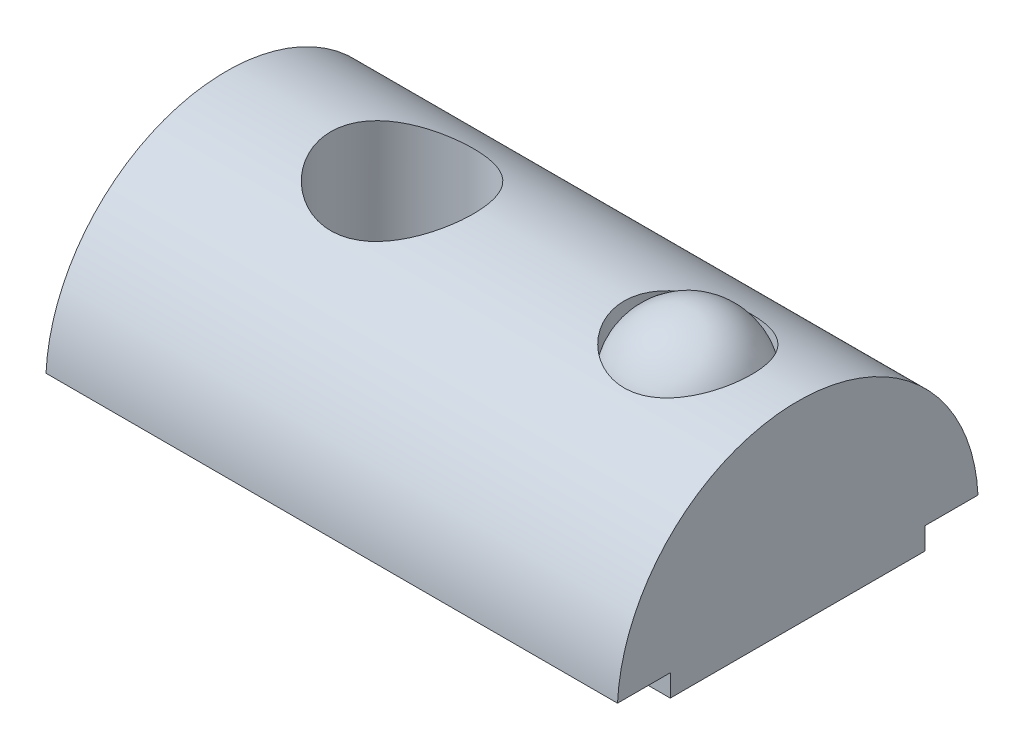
from build123d import *

# Parameters (mm, degrees)
BOSS_EXTRUDE1_DEPTH = 13
TAP1_D              = 3.242
DIAMETERHOLE1_D     = 2.9
BOSS_EXTRUDE2_REACH = 13.082
SKETCH7_R           = 1.45


with BuildPart() as part:
    # Sketch1 → Boss-Extrude1 (new body)
    with BuildSketch(Plane(origin=(-4, 0, 0), x_dir=(0, 0, -1), z_dir=(1, 0, 0))):
        with BuildLine():
            Line((4.1, 0.5), (2.9, 0.5))
            Line((2.9, 0.5), (2.9, 0))
            Line((2.9, 0), (-2.9, 0))
            Line((-2.9, 0), (-2.9, 0.5))
            Line((-2.9, 0.5), (-4.1, 0.5))
            ThreePointArc((-4.1, 0.5), (0, 4.4), (4.1, 0.5))
        make_face()
    extrude(amount=BOSS_EXTRUDE1_DEPTH)

    # Tap1 (through all)
    with Locations(Plane(origin=(0, 0, 0), x_dir=(-1, 0, 0), z_dir=(0, -1, 0))):
        with Locations((0, 0)):
            Hole(TAP1_D / 2)

    # DiameterHole1 (through all)
    with Locations(Plane(origin=(0, 0, 0), x_dir=(-1, 0, 0), z_dir=(0, -1, 0))):
        with Locations((-6.5, 0)):
            Hole(DIAMETERHOLE1_D / 2)

    # Sketch4 → Revolve1 (revolve)
    with BuildSketch(Plane(origin=(0, 0, 0), x_dir=(-1, 0, 0), z_dir=(0, 0, -1))):
        with BuildLine():
            Line((-6.5, 5), (-6.5, 2))
            ThreePointArc((-6.5, 2), (-5, 3.5), (-6.5, 5))
        make_face()
    revolve(axis=Axis((6.5, 5, 0), (0, -1, 0)))

    # Sketch7 → Boss-Extrude2 (add, up to next)
    with BuildSketch(Plane.XZ, mode=Mode.PRIVATE) as boss_extrude2_sk1:
        with Locations(Location((6.5, 0, 0), (0, 0, 270))):
            Circle(SKETCH7_R)
    boss_extrude2_tool1 = extrude(boss_extrude2_sk1.sketch, amount=-BOSS_EXTRUDE2_REACH, mode=Mode.PRIVATE) - part.part
    add(boss_extrude2_tool1.solids().sort_by_distance((6.5, 0, 0))[0])


solid = part.part
